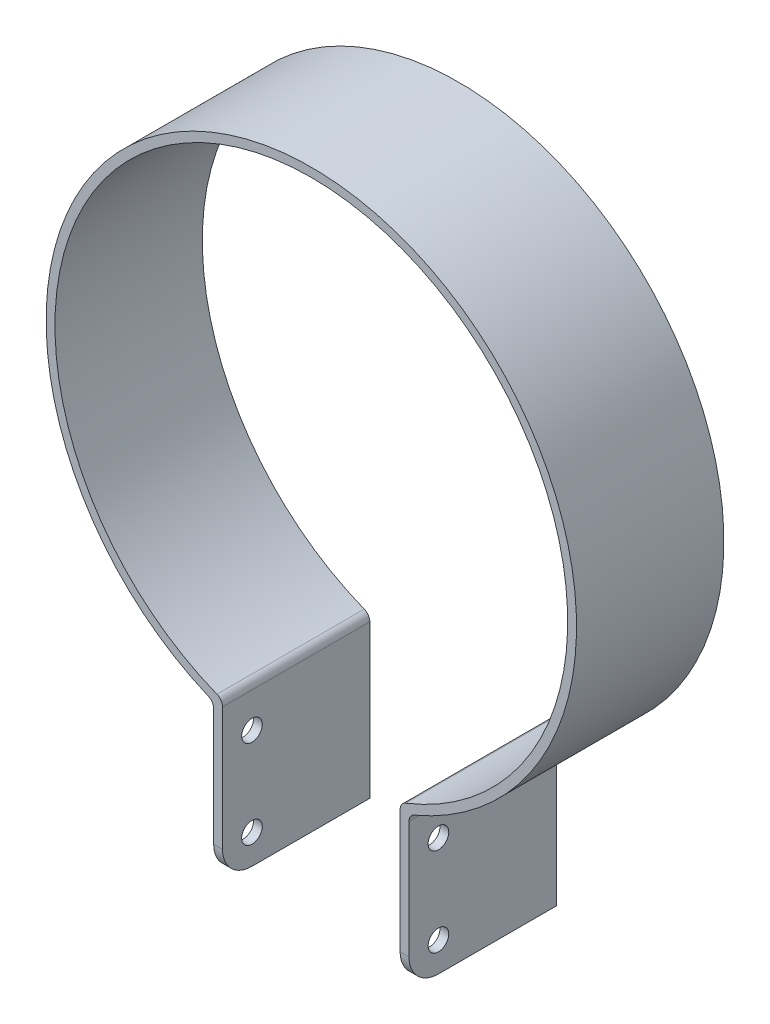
from build123d import *

# Parameters (mm, degrees)
EXTRUDE1_DEPTH = 25
FILLET1_R      = 5
SKETCH2_R      = 1.75
EXTRUDE2_DEPTH = 95.911566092


with BuildPart() as part:
    # Sketch1 → Extrude1 (new body)
    with BuildSketch(Plane.XY):
        with BuildLine():
            Line((-15.07, -41.838201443), (-15.07, -67.766809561))
            Line((-15.07, -67.766809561), (-16.57, -67.766809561))
            Line((-16.57, -67.766809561), (-16.57, -42.845362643))
            ThreePointArc((-16.57, -42.845362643), (-16.820129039, -42.016011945), (-17.487096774, -41.463254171))
            ThreePointArc((-17.487096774, -41.463254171), (0, 45), (17.487096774, -41.463254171))
            ThreePointArc((17.487096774, -41.463254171), (16.820129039, -42.016011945), (16.57, -42.845362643))
            Line((16.57, -42.845362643), (16.57, -67.766809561))
            Line((16.57, -67.766809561), (15.07, -67.766809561))
            Line((15.07, -67.766809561), (15.07, -41.838201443))
            ThreePointArc((15.07, -41.838201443), (15.329334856, -40.99514154), (16.017666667, -40.443594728))
            ThreePointArc((16.017666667, -40.443594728), (0, 43.5), (-16.017666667, -40.443594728))
            ThreePointArc((-16.017666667, -40.443594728), (-15.329334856, -40.99514154), (-15.07, -41.838201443))
        make_face()
    extrude(amount=EXTRUDE1_DEPTH)

    # Fillet1
    fillet1_edges = [part.edges().sort_by_distance(p)[0] for p in [
        (15.82, -67.766809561, 25),
        (-15.82, -67.766809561, 25),
    ]]
    fillet(fillet1_edges, radius=FILLET1_R)

    # Sketch2 → Extrude2 (cut, through all)
    with BuildSketch(Plane(origin=(16.57, 0, 0), x_dir=(0, 0, -1), z_dir=(1, 0, 0))):
        with Locations(Location((-20, -47.766809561, 0), (0, 0, 90))):
            Circle(SKETCH2_R)
        with Locations(Location((-20, -62.766809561, 0), (0, 0, 90))):
            Circle(SKETCH2_R)
    extrude(amount=-EXTRUDE2_DEPTH, mode=Mode.SUBTRACT)


solid = part.part
